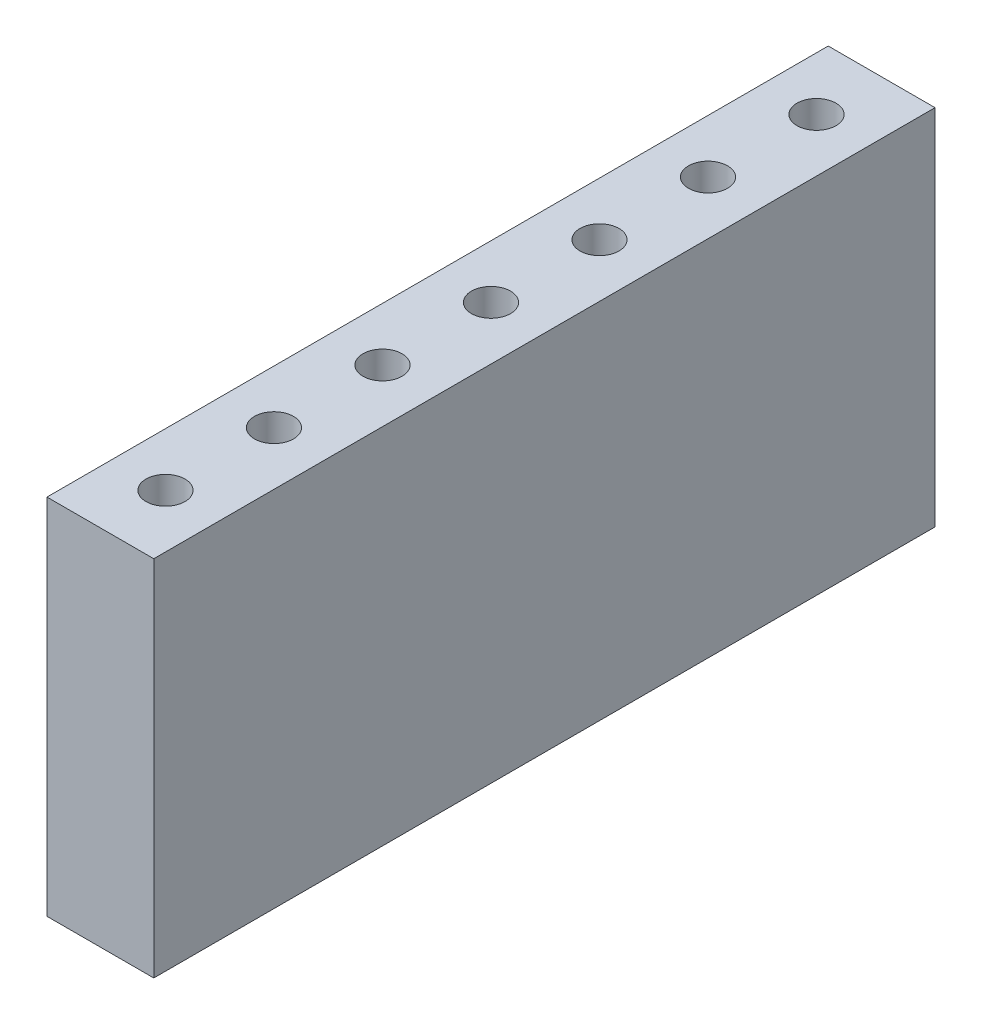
from build123d import *

# Parameters (mm, degrees)
SKETCH1_W          = 2.5
SKETCH1_H          = 18.288
EXTRUDE1_DEPTH     = 8.5
SKETCH2_R          = 0.4572
CUT_EXTRUDE1_DEPTH = 6.38


with BuildPart() as part:
    # Sketch1 → Extrude1 (new body)
    with BuildSketch(Plane(origin=(0, 0, 0), x_dir=(1, 0, 0), z_dir=(0, 1, 0))):
        with Locations((1.25, 9.144)):
            Rectangle(SKETCH1_W, SKETCH1_H)
    extrude(amount=EXTRUDE1_DEPTH)

    # Sketch2 → Cut-Extrude1 (cut)
    with BuildSketch(Plane(origin=(0, 8.5, 0), x_dir=(-1, 0, 0), z_dir=(0, 1, 0))):
        with Locations(Location((-1.25, -1.524, 0), (0, 0, 90))):
            Circle(SKETCH2_R)
        with Locations(Location((-1.25, -4.064, 0), (0, 0, 90))):
            Circle(SKETCH2_R)
        with Locations(Location((-1.25, -6.604, 0), (0, 0, 90))):
            Circle(SKETCH2_R)
        with Locations(Location((-1.25, -9.144, 0), (0, 0, 90))):
            Circle(SKETCH2_R)
        with Locations(Location((-1.25, -11.684, 0), (0, 0, 90))):
            Circle(SKETCH2_R)
        with Locations(Location((-1.25, -14.224, 0), (0, 0, 90))):
            Circle(SKETCH2_R)
        with Locations(Location((-1.25, -16.764, 0), (0, 0, 90))):
            Circle(SKETCH2_R)
    extrude(amount=-CUT_EXTRUDE1_DEPTH, mode=Mode.SUBTRACT)


solid = part.part
